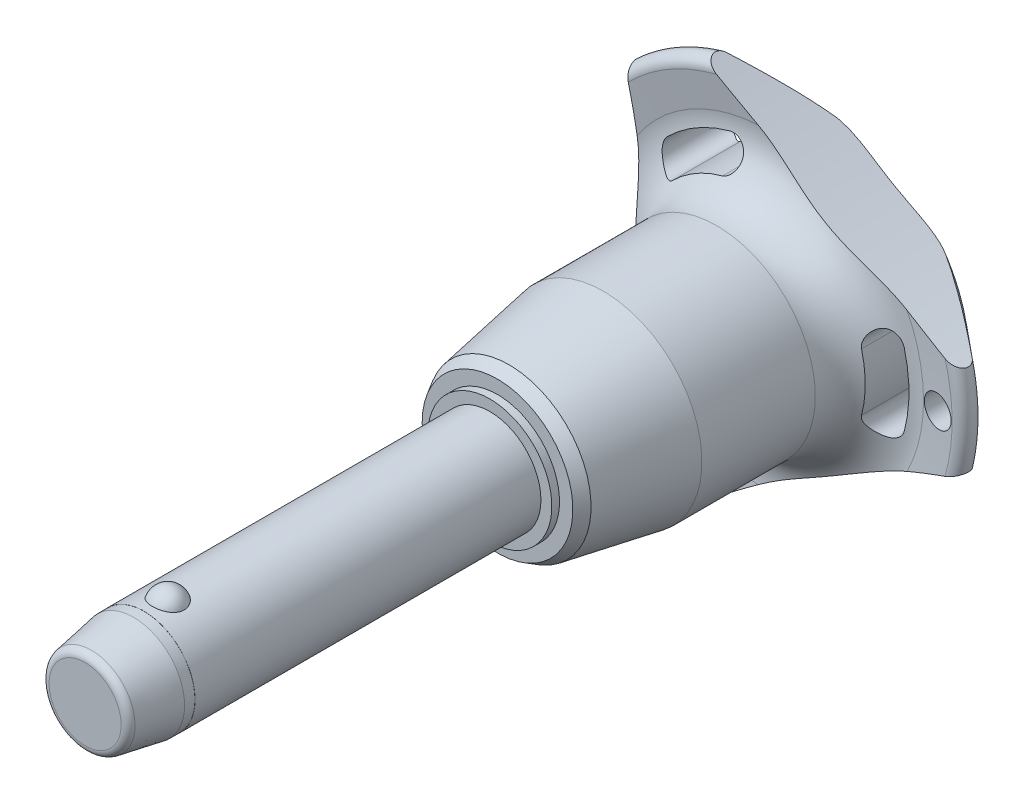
from build123d import *

# Parameters (mm, degrees)
SKETCH1_R           = 5
BOSS_EXTRUDE1_DEPTH = 30
SKETCH2_R           = 4.25
BOSS_EXTRUDE2_DEPTH = 33.3
BOSS_EXTRUDE3_START = 9.6
SKETCH1_2_R         = 5
BOSS_EXTRUDE3_DEPTH = 9.6
CHAMFER1_SIZE       = 4.8
CHAMFER1_SIZE2      = 0.846369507
FILLET1_R           = 0.75
SKETCH6_R           = 102.8
CUT_EXTRUDE1_DEPTH  = 70.10619492
CIRPATTERN1_COUNT   = 3
SKETCH7_R           = 1.5
CUT_EXTRUDE2_DEPTH  = 69.871754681
SKETCH8_R           = 5
SKETCH8_R_2         = 4.99
CUT_EXTRUDE3_DEPTH  = 5.76


with BuildPart() as part:
    # Sketch1 → Boss-Extrude1 (new body)
    with BuildSketch(Plane.XY):
        Circle(SKETCH1_R)
    extrude(amount=-BOSS_EXTRUDE1_DEPTH)

    # Sketch2 → Boss-Extrude2 (add)
    with BuildSketch(Plane(origin=(0, 0, -30), x_dir=(-1, 0, 0), z_dir=(0, 0, -1))):
        Circle(SKETCH2_R)
    extrude(amount=BOSS_EXTRUDE2_DEPTH)

    # Sketch3 → Revolve1 (revolve)
    with BuildSketch(Plane(origin=(0, 0, 0), x_dir=(0, 0, -1), z_dir=(1, 0, 0))):
        with BuildLine():
            Line((-1.516575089, 6), (-1.516575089, 2.7))
            ThreePointArc((-1.516575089, 2.7), (0.133424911, 4.35), (-1.516575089, 6))
        make_face()
        with BuildLine():
            Line((-1.516575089, -2.7), (-1.516575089, -6))
            ThreePointArc((-1.516575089, -6), (0.133424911, -4.35), (-1.516575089, -2.7))
        make_face()
    revolve(axis=Axis((0, -2.7, 1.516575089), (0, 1, 0)))

    # Sketch1_2 → Boss-Extrude3 (add)
    with BuildSketch(Plane.XY.offset(BOSS_EXTRUDE3_START)):
        Circle(SKETCH1_2_R)
    extrude(amount=-BOSS_EXTRUDE3_DEPTH)

    # Chamfer1
    chamfer1_edges = [part.edges().sort_by_distance(p)[0] for p in [
        (-5, 0, 9.6),
    ]]
    chamfer1_side = [part.faces().sort_by_distance(p)[0] for p in [
        (-5, 0, -10.2),
    ]]
    chamfer(chamfer1_edges, length=CHAMFER1_SIZE, length2=CHAMFER1_SIZE2, reference=chamfer1_side[0])

    # Fillet1
    fillet1_edges = [part.edges().sort_by_distance(p)[0] for p in [
        (-4.153630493, 0, 9.6),
        (4.25, 0, -63.3),
    ]]
    fillet(fillet1_edges, radius=FILLET1_R)

    # Sketch4 → Revolve2 (revolve)
    with BuildSketch(Plane(origin=(0, 0, 0), x_dir=(0, 0, -1), z_dir=(1, 0, 0)), mode=Mode.PRIVATE) as revolve2_sk:
        Polygon((30, 0), (30, 6.067402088), (30.75, 6.067402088), (30.75, 7.371950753), (31.879772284, 8.024225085), (41.1, 9.65), (52.2, 9.65), (52.2, 0), align=None)
    revolve(revolve2_sk.sketch.rotate(Axis((0, 0, -52.2), (0, 0, 1)), 90), axis=Axis((0, 0, -52.2), (0, 0, 1)))

    # Sketch5 → Revolve3 (revolve)
    with BuildSketch(Plane(origin=(0, 0, 0), x_dir=(0, 0, -1), z_dir=(1, 0, 0)), mode=Mode.PRIVATE) as revolve3_sk:
        with BuildLine():
            Line((57.16082631, 15.274661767), (56.757834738, 18.475067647))
            ThreePointArc((56.757834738, 18.475067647), (57.349836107, 19.516443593), (58.516044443, 19.24278761))
            Line((58.516044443, 19.24278761), (62.835691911, 14.094832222))
            ThreePointArc((62.835691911, 14.094832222), (63.3, 12.689260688), (62.67067517, 11.349423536))
            ThreePointArc((62.67067517, 11.349423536), (59.033110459, 6.185112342), (57.75, 0))
            Line((57.75, 0), (52.2, 0))
            Line((52.2, 0), (52.2, 9.65))
            ThreePointArc((52.2, 9.65), (55.949887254, 11.342683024), (57.16082631, 15.274661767))
        make_face()
    revolve(revolve3_sk.sketch.rotate(Axis((0, 0, -57.75), (0, 0, 1)), 90), axis=Axis((0, 0, -57.75), (0, 0, 1)))

    # Sketch6 → Cut-Extrude1 (cut, through all)
    with BuildSketch(Plane.XY):
        with Locations((-115.2, 0)):
            Circle(SKETCH6_R)
        with BuildLine():
            ThreePointArc((13.411913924, -3.529271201), (13.868496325, 0), (13.411913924, 3.529271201))
            ThreePointArc((13.411913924, 3.529271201), (11.694200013, 4.531299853), (10.692171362, 2.813585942))
            ThreePointArc((10.692171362, 2.813585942), (11.056165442, 0), (10.692171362, -2.813585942))
            ThreePointArc((10.692171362, -2.813585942), (11.694200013, -4.531299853), (13.411913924, -3.529271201))
        make_face()
    cut_extrude1 = extrude(amount=-CUT_EXTRUDE1_DEPTH, mode=Mode.SUBTRACT)

    # CirPattern1: Cut-Extrude1 ×3 about axis
    cirpattern1_axis = Axis((0, 0, 0), (0, 0, 1))
    for i in range(1, CIRPATTERN1_COUNT):
        add(cut_extrude1.rotate(cirpattern1_axis, i * 360 / CIRPATTERN1_COUNT), mode=Mode.SUBTRACT)

    # Sketch7 → Cut-Extrude2 (cut, through all)
    with BuildSketch(Plane.XY):
        with Locations(Location((16.868496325, 0, 0), (0, 0, 225.467095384))):
            Circle(SKETCH7_R)
    extrude(amount=-CUT_EXTRUDE2_DEPTH, mode=Mode.SUBTRACT)

    # Sketch8 → Cut-Extrude3 (cut)
    with BuildSketch(Plane.XY.offset(9.6)):
        Circle(SKETCH8_R)
        Circle(SKETCH8_R_2, mode=Mode.SUBTRACT)
    extrude(amount=-CUT_EXTRUDE3_DEPTH, mode=Mode.SUBTRACT)


solid = part.part
